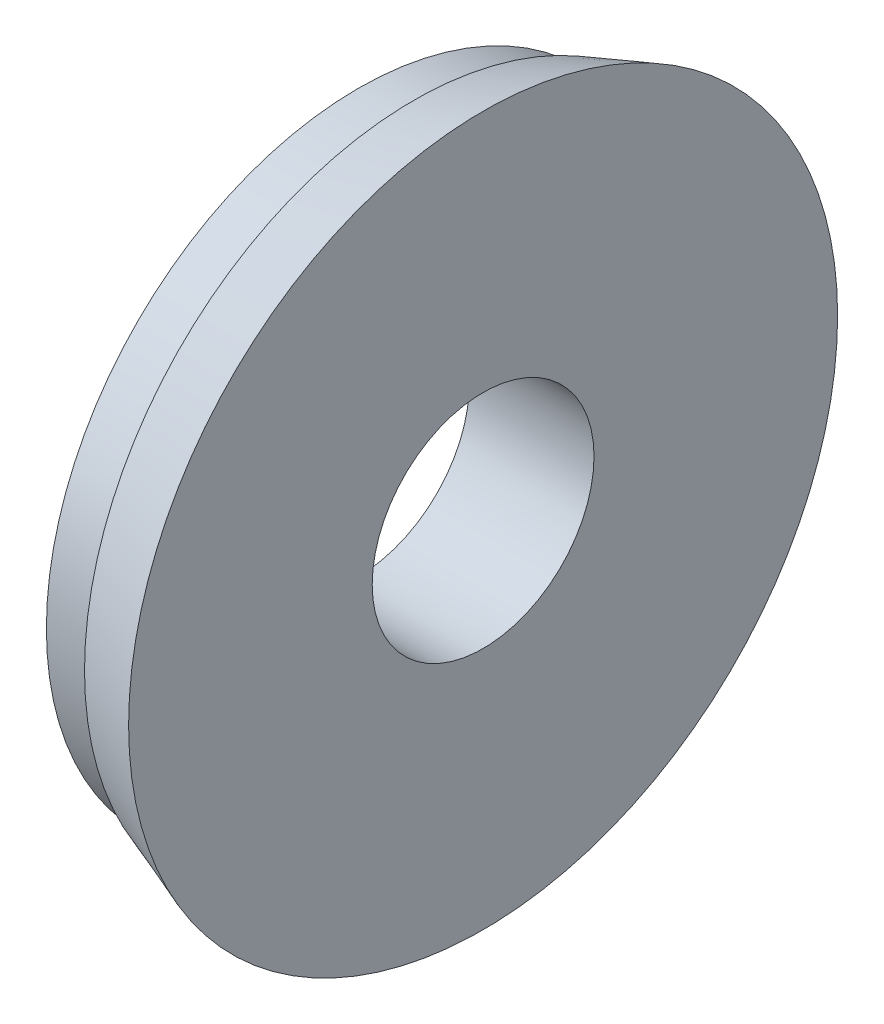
from build123d import *

# Parameters (mm, degrees)
SKETCH1_W        = 1.6
SKETCH1_H        = 5.8
ESQUISSE1_R      = 9.5
EXTRUSION1_DEPTH = 2
EXTRUSION1_DRAFT = -20
EXTRUSION2_REACH = 16.602
ESQUISSE2_R      = 3.2


with BuildPart() as part:
    # Sketch1 → Base-Revolve (revolve)
    with BuildSketch(Plane.XY, mode=Mode.PRIVATE) as base_revolve_sk:
        with Locations((-0.8, 6.1)):
            Rectangle(SKETCH1_W, SKETCH1_H)
    revolve(base_revolve_sk.sketch.rotate(Axis((-34.925, 0, 0), (1, 0, 0)), 90), axis=Axis((-34.925, 0, 0), (1, 0, 0)))


with BuildPart() as extrusion1_tool:
    # Esquisse1 → Extrusion1 (with draft: the straight prism first)
    with BuildSketch(Plane(origin=(0, 0, 0), x_dir=(0, 0, -1), z_dir=(1, 0, 0))):
        Circle(ESQUISSE1_R)
    extrude(amount=EXTRUSION1_DEPTH)
    # Extrusion1: the draft: its side faces are tilted about the plane it starts from
    extrusion1_sides = [extrusion1_tool.faces().sort_by_distance(p)[0] for p in [
        (1, 0, 9.5),
    ]]
    draft(extrusion1_sides, Plane(origin=(0, 0, 0), x_dir=(0, 0, -1), z_dir=(1, 0, 0)), EXTRUSION1_DRAFT)


with BuildPart() as part_1:
    add(part.part)

    # Extrusion1: add extrusion1_tool
    add(extrusion1_tool.part)

    # Esquisse2 → Extrusion2 (cut, up to next)
    with BuildSketch(Plane.ZY, mode=Mode.PRIVATE) as extrusion2_sk1:
        Circle(ESQUISSE2_R)
    extrusion2_tool1 = extrude(extrusion2_sk1.sketch, amount=-EXTRUSION2_REACH, mode=Mode.PRIVATE) & part_1.part
    add(extrusion2_tool1.solids().sort_by_distance((0, 0, 0))[0], mode=Mode.SUBTRACT)


solid = part_1.part
